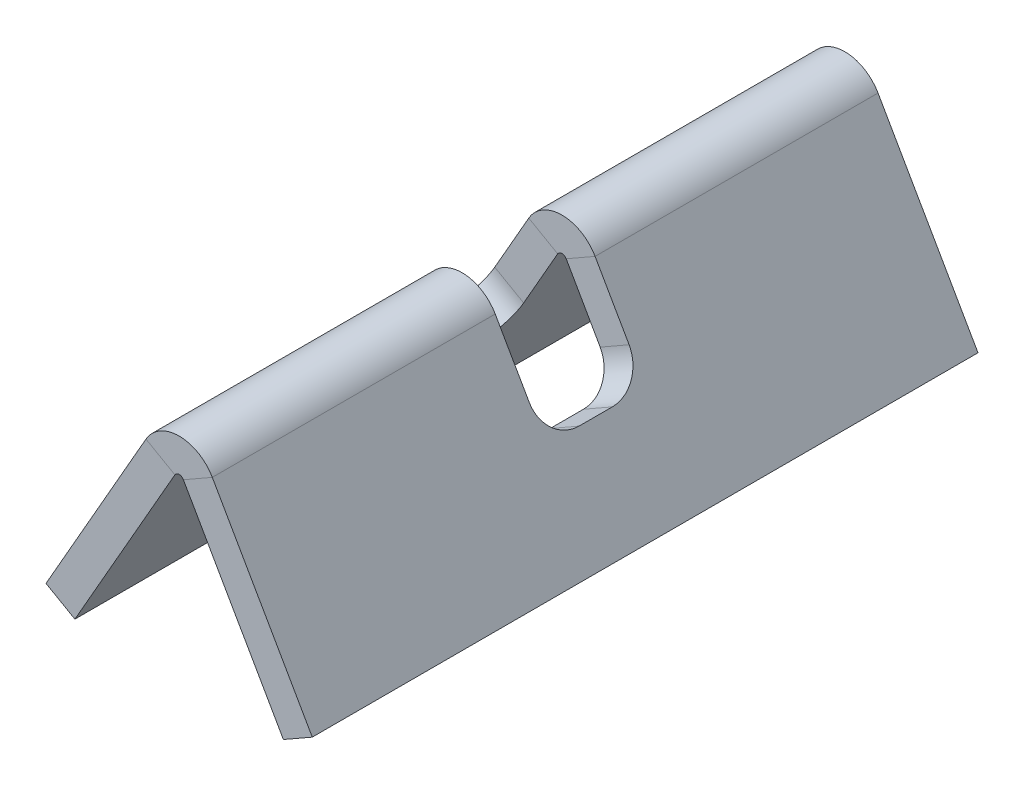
ISO-10303-21;
HEADER;
FILE_DESCRIPTION(('STEP AP214'),'2;1');
FILE_NAME('part.step','',(''),(''),'','','');
FILE_SCHEMA(('AUTOMOTIVE_DESIGN { 1 0 10303 214 1 1 1 1 }'));
ENDSEC;
DATA;
#1=APPLICATION_CONTEXT('core data for automotive mechanical design processes');
#2=APPLICATION_PROTOCOL_DEFINITION('international standard','automotive_design',2000,#1);
#3=PRODUCT_CONTEXT('',#1,'mechanical');
#4=PRODUCT('Part','Part','',(#3));
#5=PRODUCT_RELATED_PRODUCT_CATEGORY('part','',(#4));
#6=PRODUCT_DEFINITION_FORMATION('','',#4);
#7=PRODUCT_DEFINITION_CONTEXT('part definition',#1,'design');
#8=PRODUCT_DEFINITION('design','',#6,#7);
#9=PRODUCT_DEFINITION_SHAPE('','',#8);
#10=(LENGTH_UNIT() NAMED_UNIT(*) SI_UNIT(.MILLI.,.METRE.));
#11=(NAMED_UNIT(*) PLANE_ANGLE_UNIT() SI_UNIT($,.RADIAN.));
#12=(NAMED_UNIT(*) SI_UNIT($,.STERADIAN.) SOLID_ANGLE_UNIT());
#13=UNCERTAINTY_MEASURE_WITH_UNIT(LENGTH_MEASURE(1.E-05),#10,'distance_accuracy_value','');
#14=(GEOMETRIC_REPRESENTATION_CONTEXT(3) GLOBAL_UNCERTAINTY_ASSIGNED_CONTEXT((#13)) GLOBAL_UNIT_ASSIGNED_CONTEXT((#10,
#11,#12)) REPRESENTATION_CONTEXT('',''));
#15=CARTESIAN_POINT('',(0.,0.,0.));
#16=DIRECTION('',(0.,0.,1.));
#17=DIRECTION('',(1.,0.,0.));
#18=AXIS2_PLACEMENT_3D('',#15,#16,#17);
#19=CARTESIAN_POINT('',(-4.3412157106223,-2.48069469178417,50.));
#20=DIRECTION('',(0.868243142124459,0.496138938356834,0.));
#21=DIRECTION('',(-0.496138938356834,0.868243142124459,0.));
#22=AXIS2_PLACEMENT_3D('',#19,#20,#21);
#23=PLANE('',#22);
#24=DIRECTION('',(0.496138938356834,-0.868243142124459,0.));
#25=VECTOR('',#24,1.);
#26=CARTESIAN_POINT('',(-4.3412157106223,-2.48069469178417,7.5));
#27=LINE('',#26,#25);
#28=CARTESIAN_POINT('',(0.639547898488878,-11.1970310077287,7.5));
#29=VERTEX_POINT('',#28);
#30=CARTESIAN_POINT('',(5.74951816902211,-20.1394789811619,7.5));
#31=VERTEX_POINT('',#30);
#32=EDGE_CURVE('E178',#29,#31,#27,.T.);
#33=ORIENTED_EDGE('',*,*,#32,.T.);
#34=CARTESIAN_POINT('',(5.74951816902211,-20.1394789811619,2.5));
#35=DIRECTION('',(0.868243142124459,0.496138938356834,0.));
#36=DIRECTION('',(-0.496138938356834,0.868243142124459,0.));
#37=AXIS2_PLACEMENT_3D('',#34,#35,#36);
#38=CIRCLE('',#37,5.);
#39=CARTESIAN_POINT('',(8.23021286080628,-24.4806946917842,2.5));
#40=VERTEX_POINT('',#39);
#41=EDGE_CURVE('E269',#31,#40,#38,.T.);
#42=ORIENTED_EDGE('',*,*,#41,.T.);
#43=DIRECTION('',(0.,0.,1.));
#44=VECTOR('',#43,1.);
#45=CARTESIAN_POINT('',(8.23021286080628,-24.4806946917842,50.));
#46=LINE('',#45,#44);
#47=CARTESIAN_POINT('',(8.23021286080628,-24.4806946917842,-2.5));
#48=VERTEX_POINT('',#47);
#49=EDGE_CURVE('E311',#40,#48,#46,.F.);
#50=ORIENTED_EDGE('',*,*,#49,.T.);
#51=CARTESIAN_POINT('',(5.7495181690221,-20.1394789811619,-2.5));
#52=DIRECTION('',(0.868243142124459,0.496138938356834,0.));
#53=DIRECTION('',(-0.496138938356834,0.868243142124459,0.));
#54=AXIS2_PLACEMENT_3D('',#51,#52,#53);
#55=CIRCLE('',#54,5.);
#56=CARTESIAN_POINT('',(5.74951816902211,-20.1394789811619,-7.5));
#57=VERTEX_POINT('',#56);
#58=EDGE_CURVE('E273',#48,#57,#55,.T.);
#59=ORIENTED_EDGE('',*,*,#58,.T.);
#60=DIRECTION('',(0.496138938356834,-0.868243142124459,0.));
#61=VECTOR('',#60,1.);
#62=CARTESIAN_POINT('',(-4.3412157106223,-2.48069469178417,-7.5));
#63=LINE('',#62,#61);
#64=CARTESIAN_POINT('',(0.639547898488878,-11.1970310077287,-7.5));
#65=VERTEX_POINT('',#64);
#66=EDGE_CURVE('E189',#65,#57,#63,.T.);
#67=ORIENTED_EDGE('',*,*,#66,.F.);
#68=DIRECTION('',(0.,0.,-1.));
#69=VECTOR('',#68,1.);
#70=CARTESIAN_POINT('',(0.639547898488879,-11.1970310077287,50.));
#71=LINE('',#70,#69);
#72=CARTESIAN_POINT('',(0.639547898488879,-11.1970310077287,-50.));
#73=VERTEX_POINT('',#72);
#74=EDGE_CURVE('E218',#65,#73,#71,.T.);
#75=ORIENTED_EDGE('',*,*,#74,.T.);
#76=DIRECTION('',(0.496138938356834,-0.868243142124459,0.));
#77=VECTOR('',#76,1.);
#78=CARTESIAN_POINT('',(-4.3412157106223,-2.48069469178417,-50.));
#79=LINE('',#78,#77);
#80=CARTESIAN_POINT('',(15.6587842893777,-37.4806946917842,-50.));
#81=VERTEX_POINT('',#80);
#82=EDGE_CURVE('E200',#73,#81,#79,.T.);
#83=ORIENTED_EDGE('',*,*,#82,.T.);
#84=DIRECTION('',(0.,0.,-1.));
#85=VECTOR('',#84,1.);
#86=CARTESIAN_POINT('',(15.6587842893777,-37.4806946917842,50.));
#87=LINE('',#86,#85);
#88=CARTESIAN_POINT('',(15.6587842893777,-37.4806946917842,50.));
#89=VERTEX_POINT('',#88);
#90=EDGE_CURVE('E240',#89,#81,#87,.T.);
#91=ORIENTED_EDGE('',*,*,#90,.F.);
#92=DIRECTION('',(0.496138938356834,-0.868243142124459,0.));
#93=VECTOR('',#92,1.);
#94=CARTESIAN_POINT('',(-4.3412157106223,-2.48069469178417,50.));
#95=LINE('',#94,#93);
#96=CARTESIAN_POINT('',(0.639547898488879,-11.1970310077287,50.));
#97=VERTEX_POINT('',#96);
#98=EDGE_CURVE('E216',#97,#89,#95,.T.);
#99=ORIENTED_EDGE('',*,*,#98,.F.);
#100=EDGE_CURVE('E208',#97,#29,#71,.T.);
#101=ORIENTED_EDGE('',*,*,#100,.T.);
#102=EDGE_LOOP('',(#33,#42,#50,#59,#67,#75,#83,#91,#99,#101));
#103=FACE_BOUND('',#102,.T.);
#104=ADVANCED_FACE('F41',(#103),#23,.F.);
#105=CARTESIAN_POINT('',(0.,0.,50.));
#106=DIRECTION('',(0.868243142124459,0.496138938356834,0.));
#107=DIRECTION('',(-0.496138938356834,0.868243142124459,0.));
#108=AXIS2_PLACEMENT_3D('',#105,#106,#107);
#109=PLANE('',#108);
#110=DIRECTION('',(0.,0.,-1.));
#111=VECTOR('',#110,1.);
#112=CARTESIAN_POINT('',(12.5714285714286,-22.,50.));
#113=LINE('',#112,#111);
#114=CARTESIAN_POINT('',(12.5714285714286,-22.,2.5));
#115=VERTEX_POINT('',#114);
#116=CARTESIAN_POINT('',(12.5714285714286,-22.,-2.5));
#117=VERTEX_POINT('',#116);
#118=EDGE_CURVE('E310',#115,#117,#113,.T.);
#119=ORIENTED_EDGE('',*,*,#118,.F.);
#120=CARTESIAN_POINT('',(10.0907338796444,-17.6587842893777,2.5));
#121=DIRECTION('',(0.868243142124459,0.496138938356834,0.));
#122=DIRECTION('',(-0.496138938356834,0.868243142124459,0.));
#123=AXIS2_PLACEMENT_3D('',#120,#121,#122);
#124=CIRCLE('',#123,5.);
#125=CARTESIAN_POINT('',(10.0907338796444,-17.6587842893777,7.5));
#126=VERTEX_POINT('',#125);
#127=EDGE_CURVE('E271',#115,#126,#124,.F.);
#128=ORIENTED_EDGE('',*,*,#127,.T.);
#129=DIRECTION('',(-0.496138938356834,0.868243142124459,0.));
#130=VECTOR('',#129,1.);
#131=CARTESIAN_POINT('',(0.,0.,7.5));
#132=LINE('',#131,#130);
#133=CARTESIAN_POINT('',(4.98076360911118,-8.71633631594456,7.5));
#134=VERTEX_POINT('',#133);
#135=EDGE_CURVE('E316',#134,#126,#132,.F.);
#136=ORIENTED_EDGE('',*,*,#135,.F.);
#137=DIRECTION('',(0.,0.,-1.));
#138=VECTOR('',#137,1.);
#139=CARTESIAN_POINT('',(4.98076360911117,-8.71633631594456,50.));
#140=LINE('',#139,#138);
#141=CARTESIAN_POINT('',(4.98076360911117,-8.71633631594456,50.));
#142=VERTEX_POINT('',#141);
#143=EDGE_CURVE('E235',#142,#134,#140,.T.);
#144=ORIENTED_EDGE('',*,*,#143,.F.);
#145=DIRECTION('',(0.496138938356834,-0.868243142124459,0.));
#146=VECTOR('',#145,1.);
#147=CARTESIAN_POINT('',(0.,0.,50.));
#148=LINE('',#147,#146);
#149=CARTESIAN_POINT('',(20.,-35.,50.));
#150=VERTEX_POINT('',#149);
#151=EDGE_CURVE('E328',#142,#150,#148,.T.);
#152=ORIENTED_EDGE('',*,*,#151,.T.);
#153=DIRECTION('',(0.,0.,-1.));
#154=VECTOR('',#153,1.);
#155=CARTESIAN_POINT('',(20.,-35.,50.));
#156=LINE('',#155,#154);
#157=CARTESIAN_POINT('',(20.,-35.,-50.));
#158=VERTEX_POINT('',#157);
#159=EDGE_CURVE('E238',#150,#158,#156,.T.);
#160=ORIENTED_EDGE('',*,*,#159,.T.);
#161=DIRECTION('',(0.496138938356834,-0.868243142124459,0.));
#162=VECTOR('',#161,1.);
#163=CARTESIAN_POINT('',(0.,0.,-50.));
#164=LINE('',#163,#162);
#165=CARTESIAN_POINT('',(4.98076360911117,-8.71633631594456,-50.));
#166=VERTEX_POINT('',#165);
#167=EDGE_CURVE('E350',#166,#158,#164,.T.);
#168=ORIENTED_EDGE('',*,*,#167,.F.);
#169=CARTESIAN_POINT('',(4.98076360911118,-8.71633631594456,-7.5));
#170=VERTEX_POINT('',#169);
#171=EDGE_CURVE('E234',#170,#166,#140,.T.);
#172=ORIENTED_EDGE('',*,*,#171,.F.);
#173=DIRECTION('',(-0.496138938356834,0.868243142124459,0.));
#174=VECTOR('',#173,1.);
#175=CARTESIAN_POINT('',(0.,0.,-7.5));
#176=LINE('',#175,#174);
#177=CARTESIAN_POINT('',(10.0907338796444,-17.6587842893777,-7.5));
#178=VERTEX_POINT('',#177);
#179=EDGE_CURVE('E188',#170,#178,#176,.F.);
#180=ORIENTED_EDGE('',*,*,#179,.T.);
#181=CARTESIAN_POINT('',(10.0907338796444,-17.6587842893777,-2.5));
#182=DIRECTION('',(0.868243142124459,0.496138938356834,0.));
#183=DIRECTION('',(-0.496138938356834,0.868243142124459,0.));
#184=AXIS2_PLACEMENT_3D('',#181,#182,#183);
#185=CIRCLE('',#184,5.);
#186=EDGE_CURVE('E275',#178,#117,#185,.F.);
#187=ORIENTED_EDGE('',*,*,#186,.T.);
#188=EDGE_LOOP('',(#119,#128,#136,#144,#152,#160,#168,#172,#180,#187));
#189=FACE_BOUND('',#188,.T.);
#190=ADVANCED_FACE('F423',(#189),#109,.T.);
#191=CARTESIAN_POINT('',(0.,-11.5624869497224,50.));
#192=DIRECTION('',(0.,0.,-1.));
#193=DIRECTION('',(-1.,0.,0.));
#194=AXIS2_PLACEMENT_3D('',#191,#192,#193);
#195=CYLINDRICAL_SURFACE('',#194,5.7366);
#196=ORIENTED_EDGE('',*,*,#143,.T.);
#197=CARTESIAN_POINT('',(0.,-11.5624869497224,7.5));
#198=DIRECTION('',(0.,0.,1.));
#199=DIRECTION('',(1.,0.,0.));
#200=AXIS2_PLACEMENT_3D('',#197,#198,#199);
#201=CIRCLE('',#200,5.7366);
#202=CARTESIAN_POINT('',(-4.98076360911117,-8.71633631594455,7.5));
#203=VERTEX_POINT('',#202);
#204=EDGE_CURVE('E199',#203,#134,#201,.F.);
#205=ORIENTED_EDGE('',*,*,#204,.F.);
#206=DIRECTION('',(0.,0.,-1.));
#207=VECTOR('',#206,1.);
#208=CARTESIAN_POINT('',(-4.98076360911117,-8.71633631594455,50.));
#209=LINE('',#208,#207);
#210=CARTESIAN_POINT('',(-4.98076360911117,-8.71633631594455,50.));
#211=VERTEX_POINT('',#210);
#212=EDGE_CURVE('E231',#211,#203,#209,.T.);
#213=ORIENTED_EDGE('',*,*,#212,.F.);
#214=CARTESIAN_POINT('',(0.,-11.5624869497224,50.));
#215=DIRECTION('',(0.,0.,1.));
#216=DIRECTION('',(1.,0.,0.));
#217=AXIS2_PLACEMENT_3D('',#214,#215,#216);
#218=CIRCLE('',#217,5.7366);
#219=EDGE_CURVE('E331',#211,#142,#218,.F.);
#220=ORIENTED_EDGE('',*,*,#219,.T.);
#221=EDGE_LOOP('',(#196,#205,#213,#220));
#222=FACE_BOUND('',#221,.T.);
#223=ADVANCED_FACE('F405',(#222),#195,.T.);
#224=CARTESIAN_POINT('',(-4.98076360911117,-8.71633631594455,-7.5));
#225=VERTEX_POINT('',#224);
#226=CARTESIAN_POINT('',(-4.98076360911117,-8.71633631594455,-50.));
#227=VERTEX_POINT('',#226);
#228=EDGE_CURVE('E230',#225,#227,#209,.T.);
#229=ORIENTED_EDGE('',*,*,#228,.F.);
#230=CARTESIAN_POINT('',(0.,-11.5624869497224,-7.5));
#231=DIRECTION('',(0.,0.,1.));
#232=DIRECTION('',(1.,0.,0.));
#233=AXIS2_PLACEMENT_3D('',#230,#231,#232);
#234=CIRCLE('',#233,5.7366);
#235=EDGE_CURVE('E416',#225,#170,#234,.F.);
#236=ORIENTED_EDGE('',*,*,#235,.T.);
#237=ORIENTED_EDGE('',*,*,#171,.T.);
#238=CARTESIAN_POINT('',(0.,-11.5624869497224,-50.));
#239=DIRECTION('',(0.,0.,1.));
#240=DIRECTION('',(1.,0.,0.));
#241=AXIS2_PLACEMENT_3D('',#238,#239,#240);
#242=CIRCLE('',#241,5.7366);
#243=EDGE_CURVE('E353',#227,#166,#242,.F.);
#244=ORIENTED_EDGE('',*,*,#243,.F.);
#245=EDGE_LOOP('',(#229,#236,#237,#244));
#246=FACE_BOUND('',#245,.T.);
#247=ADVANCED_FACE('F383',(#246),#195,.T.);
#248=CARTESIAN_POINT('',(0.,0.,50.));
#249=DIRECTION('',(-0.868243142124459,0.496138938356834,0.));
#250=DIRECTION('',(-0.496138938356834,-0.868243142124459,0.));
#251=AXIS2_PLACEMENT_3D('',#248,#249,#250);
#252=PLANE('',#251);
#253=ORIENTED_EDGE('',*,*,#212,.T.);
#254=DIRECTION('',(0.496138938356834,0.868243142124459,0.));
#255=VECTOR('',#254,1.);
#256=CARTESIAN_POINT('',(0.,0.,7.5));
#257=LINE('',#256,#255);
#258=CARTESIAN_POINT('',(-10.0907338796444,-17.6587842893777,7.5));
#259=VERTEX_POINT('',#258);
#260=EDGE_CURVE('E302',#259,#203,#257,.T.);
#261=ORIENTED_EDGE('',*,*,#260,.F.);
#262=CARTESIAN_POINT('',(-10.0907338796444,-17.6587842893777,2.5));
#263=DIRECTION('',(-0.868243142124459,0.496138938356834,0.));
#264=DIRECTION('',(-0.496138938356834,-0.868243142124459,0.));
#265=AXIS2_PLACEMENT_3D('',#262,#263,#264);
#266=CIRCLE('',#265,5.);
#267=CARTESIAN_POINT('',(-12.5714285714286,-22.,2.5));
#268=VERTEX_POINT('',#267);
#269=EDGE_CURVE('E279',#259,#268,#266,.F.);
#270=ORIENTED_EDGE('',*,*,#269,.T.);
#271=DIRECTION('',(0.,0.,1.));
#272=VECTOR('',#271,1.);
#273=CARTESIAN_POINT('',(-12.5714285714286,-22.,50.));
#274=LINE('',#273,#272);
#275=CARTESIAN_POINT('',(-12.5714285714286,-22.,-2.5));
#276=VERTEX_POINT('',#275);
#277=EDGE_CURVE('E300',#276,#268,#274,.T.);
#278=ORIENTED_EDGE('',*,*,#277,.F.);
#279=CARTESIAN_POINT('',(-10.0907338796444,-17.6587842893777,-2.5));
#280=DIRECTION('',(-0.868243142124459,0.496138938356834,0.));
#281=DIRECTION('',(-0.496138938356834,-0.868243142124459,0.));
#282=AXIS2_PLACEMENT_3D('',#279,#280,#281);
#283=CIRCLE('',#282,5.);
#284=CARTESIAN_POINT('',(-10.0907338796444,-17.6587842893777,-7.5));
#285=VERTEX_POINT('',#284);
#286=EDGE_CURVE('E11',#276,#285,#283,.F.);
#287=ORIENTED_EDGE('',*,*,#286,.T.);
#288=DIRECTION('',(0.496138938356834,0.868243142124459,0.));
#289=VECTOR('',#288,1.);
#290=CARTESIAN_POINT('',(0.,0.,-7.5));
#291=LINE('',#290,#289);
#292=EDGE_CURVE('E212',#285,#225,#291,.T.);
#293=ORIENTED_EDGE('',*,*,#292,.T.);
#294=ORIENTED_EDGE('',*,*,#228,.T.);
#295=DIRECTION('',(0.496138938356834,0.868243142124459,0.));
#296=VECTOR('',#295,1.);
#297=CARTESIAN_POINT('',(0.,0.,-50.));
#298=LINE('',#297,#296);
#299=CARTESIAN_POINT('',(-20.,-35.,-50.));
#300=VERTEX_POINT('',#299);
#301=EDGE_CURVE('E356',#300,#227,#298,.T.);
#302=ORIENTED_EDGE('',*,*,#301,.F.);
#303=DIRECTION('',(0.,0.,-1.));
#304=VECTOR('',#303,1.);
#305=CARTESIAN_POINT('',(-20.,-35.,50.));
#306=LINE('',#305,#304);
#307=CARTESIAN_POINT('',(-20.,-35.,50.));
#308=VERTEX_POINT('',#307);
#309=EDGE_CURVE('E228',#308,#300,#306,.T.);
#310=ORIENTED_EDGE('',*,*,#309,.F.);
#311=DIRECTION('',(0.496138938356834,0.868243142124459,0.));
#312=VECTOR('',#311,1.);
#313=CARTESIAN_POINT('',(0.,0.,50.));
#314=LINE('',#313,#312);
#315=EDGE_CURVE('E334',#308,#211,#314,.T.);
#316=ORIENTED_EDGE('',*,*,#315,.T.);
#317=EDGE_LOOP('',(#253,#261,#270,#278,#287,#293,#294,#302,#310,#316));
#318=FACE_BOUND('',#317,.T.);
#319=ADVANCED_FACE('F390',(#318),#252,.T.);
#320=CARTESIAN_POINT('',(4.3412157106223,-2.48069469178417,50.));
#321=DIRECTION('',(-0.868243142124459,0.496138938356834,0.));
#322=DIRECTION('',(-0.496138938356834,-0.868243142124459,0.));
#323=AXIS2_PLACEMENT_3D('',#320,#321,#322);
#324=PLANE('',#323);
#325=DIRECTION('',(0.,0.,1.));
#326=VECTOR('',#325,1.);
#327=CARTESIAN_POINT('',(-8.23021286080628,-24.4806946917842,50.));
#328=LINE('',#327,#326);
#329=CARTESIAN_POINT('',(-8.23021286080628,-24.4806946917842,-2.50000000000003));
#330=VERTEX_POINT('',#329);
#331=CARTESIAN_POINT('',(-8.23021286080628,-24.4806946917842,2.49999999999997));
#332=VERTEX_POINT('',#331);
#333=EDGE_CURVE('E285',#330,#332,#328,.T.);
#334=ORIENTED_EDGE('',*,*,#333,.T.);
#335=CARTESIAN_POINT('',(-5.7495181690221,-20.1394789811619,2.5));
#336=DIRECTION('',(-0.868243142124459,0.496138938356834,0.));
#337=DIRECTION('',(-0.496138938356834,-0.868243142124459,0.));
#338=AXIS2_PLACEMENT_3D('',#335,#336,#337);
#339=CIRCLE('',#338,5.);
#340=CARTESIAN_POINT('',(-5.74951816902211,-20.1394789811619,7.49999999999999));
#341=VERTEX_POINT('',#340);
#342=EDGE_CURVE('E277',#332,#341,#339,.T.);
#343=ORIENTED_EDGE('',*,*,#342,.T.);
#344=DIRECTION('',(-0.496138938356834,-0.868243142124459,0.));
#345=VECTOR('',#344,1.);
#346=CARTESIAN_POINT('',(4.3412157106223,-2.48069469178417,7.49999999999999));
#347=LINE('',#346,#345);
#348=CARTESIAN_POINT('',(-0.639547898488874,-11.1970310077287,7.5));
#349=VERTEX_POINT('',#348);
#350=EDGE_CURVE('E292',#341,#349,#347,.F.);
#351=ORIENTED_EDGE('',*,*,#350,.T.);
#352=DIRECTION('',(0.,0.,-1.));
#353=VECTOR('',#352,1.);
#354=CARTESIAN_POINT('',(-0.639547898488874,-11.1970310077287,50.));
#355=LINE('',#354,#353);
#356=CARTESIAN_POINT('',(-0.639547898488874,-11.1970310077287,50.));
#357=VERTEX_POINT('',#356);
#358=EDGE_CURVE('E211',#357,#349,#355,.T.);
#359=ORIENTED_EDGE('',*,*,#358,.F.);
#360=DIRECTION('',(0.496138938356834,0.868243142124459,0.));
#361=VECTOR('',#360,1.);
#362=CARTESIAN_POINT('',(4.3412157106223,-2.48069469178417,50.));
#363=LINE('',#362,#361);
#364=CARTESIAN_POINT('',(-15.6587842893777,-37.4806946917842,50.));
#365=VERTEX_POINT('',#364);
#366=EDGE_CURVE('E340',#365,#357,#363,.T.);
#367=ORIENTED_EDGE('',*,*,#366,.F.);
#368=DIRECTION('',(0.,0.,-1.));
#369=VECTOR('',#368,1.);
#370=CARTESIAN_POINT('',(-15.6587842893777,-37.4806946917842,50.));
#371=LINE('',#370,#369);
#372=CARTESIAN_POINT('',(-15.6587842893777,-37.4806946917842,-50.));
#373=VERTEX_POINT('',#372);
#374=EDGE_CURVE('E226',#365,#373,#371,.T.);
#375=ORIENTED_EDGE('',*,*,#374,.T.);
#376=DIRECTION('',(0.496138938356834,0.868243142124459,0.));
#377=VECTOR('',#376,1.);
#378=CARTESIAN_POINT('',(4.3412157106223,-2.48069469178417,-50.));
#379=LINE('',#378,#377);
#380=CARTESIAN_POINT('',(-0.639547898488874,-11.1970310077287,-50.));
#381=VERTEX_POINT('',#380);
#382=EDGE_CURVE('E361',#373,#381,#379,.T.);
#383=ORIENTED_EDGE('',*,*,#382,.T.);
#384=CARTESIAN_POINT('',(-0.639547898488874,-11.1970310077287,-7.5));
#385=VERTEX_POINT('',#384);
#386=EDGE_CURVE('E217',#385,#381,#355,.T.);
#387=ORIENTED_EDGE('',*,*,#386,.F.);
#388=DIRECTION('',(-0.496138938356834,-0.868243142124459,0.));
#389=VECTOR('',#388,1.);
#390=CARTESIAN_POINT('',(4.3412157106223,-2.48069469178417,-7.50000000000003));
#391=LINE('',#390,#389);
#392=CARTESIAN_POINT('',(-5.74951816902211,-20.1394789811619,-7.50000000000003));
#393=VERTEX_POINT('',#392);
#394=EDGE_CURVE('E287',#393,#385,#391,.F.);
#395=ORIENTED_EDGE('',*,*,#394,.F.);
#396=CARTESIAN_POINT('',(-5.7495181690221,-20.1394789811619,-2.5));
#397=DIRECTION('',(-0.868243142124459,0.496138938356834,0.));
#398=DIRECTION('',(-0.496138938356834,-0.868243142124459,0.));
#399=AXIS2_PLACEMENT_3D('',#396,#397,#398);
#400=CIRCLE('',#399,5.);
#401=EDGE_CURVE('E49',#393,#330,#400,.T.);
#402=ORIENTED_EDGE('',*,*,#401,.T.);
#403=EDGE_LOOP('',(#334,#343,#351,#359,#367,#375,#383,#387,#395,#402));
#404=FACE_BOUND('',#403,.T.);
#405=ADVANCED_FACE('F284',(#404),#324,.F.);
#406=CARTESIAN_POINT('',(0.,-11.5624869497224,50.));
#407=DIRECTION('',(0.,0.,-1.));
#408=DIRECTION('',(-1.,0.,0.));
#409=AXIS2_PLACEMENT_3D('',#406,#407,#408);
#410=CYLINDRICAL_SURFACE('',#409,0.7366);
#411=CARTESIAN_POINT('',(0.,-11.5624869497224,7.5));
#412=DIRECTION('',(0.,0.,-1.));
#413=DIRECTION('',(-1.,0.,0.));
#414=AXIS2_PLACEMENT_3D('',#411,#412,#413);
#415=CIRCLE('',#414,0.7366);
#416=EDGE_CURVE('E196',#349,#29,#415,.T.);
#417=ORIENTED_EDGE('',*,*,#416,.T.);
#418=ORIENTED_EDGE('',*,*,#100,.F.);
#419=CARTESIAN_POINT('',(0.,-11.5624869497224,50.));
#420=DIRECTION('',(0.,0.,1.));
#421=DIRECTION('',(1.,0.,0.));
#422=AXIS2_PLACEMENT_3D('',#419,#420,#421);
#423=CIRCLE('',#422,0.7366);
#424=EDGE_CURVE('E221',#357,#97,#423,.F.);
#425=ORIENTED_EDGE('',*,*,#424,.F.);
#426=ORIENTED_EDGE('',*,*,#358,.T.);
#427=EDGE_LOOP('',(#417,#418,#425,#426));
#428=FACE_BOUND('',#427,.T.);
#429=ADVANCED_FACE('F206',(#428),#410,.F.);
#430=CARTESIAN_POINT('',(0.,-11.5624869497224,-7.5));
#431=DIRECTION('',(0.,0.,-1.));
#432=DIRECTION('',(-1.,0.,0.));
#433=AXIS2_PLACEMENT_3D('',#430,#431,#432);
#434=CIRCLE('',#433,0.7366);
#435=EDGE_CURVE('E213',#385,#65,#434,.T.);
#436=ORIENTED_EDGE('',*,*,#435,.F.);
#437=ORIENTED_EDGE('',*,*,#386,.T.);
#438=CARTESIAN_POINT('',(0.,-11.5624869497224,-50.));
#439=DIRECTION('',(0.,0.,1.));
#440=DIRECTION('',(1.,0.,0.));
#441=AXIS2_PLACEMENT_3D('',#438,#439,#440);
#442=CIRCLE('',#441,0.7366);
#443=EDGE_CURVE('E223',#381,#73,#442,.F.);
#444=ORIENTED_EDGE('',*,*,#443,.T.);
#445=ORIENTED_EDGE('',*,*,#74,.F.);
#446=EDGE_LOOP('',(#436,#437,#444,#445));
#447=FACE_BOUND('',#446,.T.);
#448=ADVANCED_FACE('F370',(#447),#410,.F.);
#449=CARTESIAN_POINT('',(4.98076360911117,-8.71633631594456,50.));
#450=DIRECTION('',(0.,0.,1.));
#451=DIRECTION('',(1.,0.,0.));
#452=AXIS2_PLACEMENT_3D('',#449,#450,#451);
#453=PLANE('',#452);
#454=DIRECTION('',(-0.868243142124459,-0.496138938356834,0.));
#455=VECTOR('',#454,1.);
#456=CARTESIAN_POINT('',(4.98076360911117,-8.71633631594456,50.));
#457=LINE('',#456,#455);
#458=EDGE_CURVE('E250',#142,#97,#457,.T.);
#459=ORIENTED_EDGE('',*,*,#458,.F.);
#460=ORIENTED_EDGE('',*,*,#219,.F.);
#461=DIRECTION('',(-0.868243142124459,0.496138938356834,0.));
#462=VECTOR('',#461,1.);
#463=CARTESIAN_POINT('',(-0.639547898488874,-11.1970310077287,50.));
#464=LINE('',#463,#462);
#465=EDGE_CURVE('E248',#357,#211,#464,.T.);
#466=ORIENTED_EDGE('',*,*,#465,.F.);
#467=ORIENTED_EDGE('',*,*,#424,.T.);
#468=EDGE_LOOP('',(#459,#460,#466,#467));
#469=FACE_BOUND('',#468,.T.);
#470=ADVANCED_FACE('F401',(#469),#453,.T.);
#471=CARTESIAN_POINT('',(-0.639547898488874,-11.1970310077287,50.));
#472=DIRECTION('',(0.,0.,1.));
#473=DIRECTION('',(1.,0.,0.));
#474=AXIS2_PLACEMENT_3D('',#471,#472,#473);
#475=PLANE('',#474);
#476=ORIENTED_EDGE('',*,*,#151,.F.);
#477=ORIENTED_EDGE('',*,*,#458,.T.);
#478=ORIENTED_EDGE('',*,*,#98,.T.);
#479=DIRECTION('',(-0.868243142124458,-0.496138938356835,0.));
#480=VECTOR('',#479,1.);
#481=CARTESIAN_POINT('',(20.,-35.,50.));
#482=LINE('',#481,#480);
#483=EDGE_CURVE('E325',#150,#89,#482,.T.);
#484=ORIENTED_EDGE('',*,*,#483,.F.);
#485=EDGE_LOOP('',(#476,#477,#478,#484));
#486=FACE_BOUND('',#485,.T.);
#487=ADVANCED_FACE('F430',(#486),#475,.T.);
#488=CARTESIAN_POINT('',(-4.98076360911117,-8.71633631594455,-50.));
#489=DIRECTION('',(0.,0.,-1.));
#490=DIRECTION('',(-1.,0.,0.));
#491=AXIS2_PLACEMENT_3D('',#488,#489,#490);
#492=PLANE('',#491);
#493=DIRECTION('',(0.868243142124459,-0.496138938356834,0.));
#494=VECTOR('',#493,1.);
#495=CARTESIAN_POINT('',(-4.98076360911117,-8.71633631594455,-50.));
#496=LINE('',#495,#494);
#497=EDGE_CURVE('E245',#227,#381,#496,.T.);
#498=ORIENTED_EDGE('',*,*,#497,.F.);
#499=ORIENTED_EDGE('',*,*,#243,.T.);
#500=DIRECTION('',(0.868243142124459,0.496138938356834,0.));
#501=VECTOR('',#500,1.);
#502=CARTESIAN_POINT('',(0.639547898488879,-11.1970310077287,-50.));
#503=LINE('',#502,#501);
#504=EDGE_CURVE('E242',#73,#166,#503,.T.);
#505=ORIENTED_EDGE('',*,*,#504,.F.);
#506=ORIENTED_EDGE('',*,*,#443,.F.);
#507=EDGE_LOOP('',(#498,#499,#505,#506));
#508=FACE_BOUND('',#507,.T.);
#509=ADVANCED_FACE('F379',(#508),#492,.T.);
#510=CARTESIAN_POINT('',(0.639547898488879,-11.1970310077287,-50.));
#511=DIRECTION('',(0.,0.,-1.));
#512=DIRECTION('',(-1.,0.,0.));
#513=AXIS2_PLACEMENT_3D('',#510,#511,#512);
#514=PLANE('',#513);
#515=ORIENTED_EDGE('',*,*,#301,.T.);
#516=ORIENTED_EDGE('',*,*,#497,.T.);
#517=ORIENTED_EDGE('',*,*,#382,.F.);
#518=DIRECTION('',(-0.868243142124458,0.496138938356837,0.));
#519=VECTOR('',#518,1.);
#520=CARTESIAN_POINT('',(-15.6587842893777,-37.4806946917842,-50.));
#521=LINE('',#520,#519);
#522=EDGE_CURVE('E359',#373,#300,#521,.T.);
#523=ORIENTED_EDGE('',*,*,#522,.T.);
#524=EDGE_LOOP('',(#515,#516,#517,#523));
#525=FACE_BOUND('',#524,.T.);
#526=ADVANCED_FACE('F388',(#525),#514,.T.);
#527=CARTESIAN_POINT('',(20.,-35.,50.));
#528=DIRECTION('',(0.496138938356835,-0.868243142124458,0.));
#529=DIRECTION('',(0.868243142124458,0.496138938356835,0.));
#530=AXIS2_PLACEMENT_3D('',#527,#528,#529);
#531=PLANE('',#530);
#532=DIRECTION('',(-0.868243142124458,-0.496138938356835,0.));
#533=VECTOR('',#532,1.);
#534=CARTESIAN_POINT('',(20.,-35.,-50.));
#535=LINE('',#534,#533);
#536=EDGE_CURVE('E347',#158,#81,#535,.T.);
#537=ORIENTED_EDGE('',*,*,#536,.F.);
#538=ORIENTED_EDGE('',*,*,#159,.F.);
#539=ORIENTED_EDGE('',*,*,#483,.T.);
#540=ORIENTED_EDGE('',*,*,#90,.T.);
#541=EDGE_LOOP('',(#537,#538,#539,#540));
#542=FACE_BOUND('',#541,.T.);
#543=ADVANCED_FACE('F428',(#542),#531,.T.);
#544=CARTESIAN_POINT('',(-15.6587842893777,-37.4806946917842,50.));
#545=DIRECTION('',(-0.496138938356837,-0.868243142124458,0.));
#546=DIRECTION('',(0.868243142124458,-0.496138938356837,0.));
#547=AXIS2_PLACEMENT_3D('',#544,#545,#546);
#548=PLANE('',#547);
#549=ORIENTED_EDGE('',*,*,#522,.F.);
#550=ORIENTED_EDGE('',*,*,#374,.F.);
#551=DIRECTION('',(-0.868243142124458,0.496138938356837,0.));
#552=VECTOR('',#551,1.);
#553=CARTESIAN_POINT('',(-15.6587842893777,-37.4806946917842,50.));
#554=LINE('',#553,#552);
#555=EDGE_CURVE('E337',#365,#308,#554,.T.);
#556=ORIENTED_EDGE('',*,*,#555,.T.);
#557=ORIENTED_EDGE('',*,*,#309,.T.);
#558=EDGE_LOOP('',(#549,#550,#556,#557));
#559=FACE_BOUND('',#558,.T.);
#560=ADVANCED_FACE('F397',(#559),#548,.T.);
#561=CARTESIAN_POINT('',(0.,-11.5624869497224,50.));
#562=DIRECTION('',(0.,0.,1.));
#563=DIRECTION('',(1.,0.,0.));
#564=AXIS2_PLACEMENT_3D('',#561,#562,#563);
#565=PLANE('',#564);
#566=ORIENTED_EDGE('',*,*,#366,.T.);
#567=ORIENTED_EDGE('',*,*,#465,.T.);
#568=ORIENTED_EDGE('',*,*,#315,.F.);
#569=ORIENTED_EDGE('',*,*,#555,.F.);
#570=EDGE_LOOP('',(#566,#567,#568,#569));
#571=FACE_BOUND('',#570,.T.);
#572=ADVANCED_FACE('F395',(#571),#565,.T.);
#573=CARTESIAN_POINT('',(0.,-11.5624869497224,-50.));
#574=DIRECTION('',(0.,0.,1.));
#575=DIRECTION('',(1.,0.,0.));
#576=AXIS2_PLACEMENT_3D('',#573,#574,#575);
#577=PLANE('',#576);
#578=ORIENTED_EDGE('',*,*,#82,.F.);
#579=ORIENTED_EDGE('',*,*,#504,.T.);
#580=ORIENTED_EDGE('',*,*,#167,.T.);
#581=ORIENTED_EDGE('',*,*,#536,.T.);
#582=EDGE_LOOP('',(#578,#579,#580,#581));
#583=FACE_BOUND('',#582,.T.);
#584=ADVANCED_FACE('F375',(#583),#577,.F.);
#585=CARTESIAN_POINT('',(-4.3412157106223,-2.48069469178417,7.5));
#586=DIRECTION('',(0.,0.,1.));
#587=DIRECTION('',(0.496138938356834,-0.868243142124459,0.));
#588=AXIS2_PLACEMENT_3D('',#585,#586,#587);
#589=PLANE('',#588);
#590=ORIENTED_EDGE('',*,*,#135,.T.);
#591=DIRECTION('',(0.868243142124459,0.496138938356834,0.));
#592=VECTOR('',#591,1.);
#593=CARTESIAN_POINT('',(5.74951816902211,-20.1394789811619,7.5));
#594=LINE('',#593,#592);
#595=EDGE_CURVE('E185',#126,#31,#594,.F.);
#596=ORIENTED_EDGE('',*,*,#595,.T.);
#597=ORIENTED_EDGE('',*,*,#32,.F.);
#598=DIRECTION('',(-0.868243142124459,-0.496138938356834,0.));
#599=VECTOR('',#598,1.);
#600=CARTESIAN_POINT('',(0.639547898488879,-11.1970310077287,7.5));
#601=LINE('',#600,#599);
#602=EDGE_CURVE('E182',#29,#134,#601,.F.);
#603=ORIENTED_EDGE('',*,*,#602,.T.);
#604=EDGE_LOOP('',(#590,#596,#597,#603));
#605=FACE_BOUND('',#604,.T.);
#606=ADVANCED_FACE('F181',(#605),#589,.F.);
#607=CARTESIAN_POINT('',(-4.3412157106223,-2.48069469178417,-7.5));
#608=DIRECTION('',(0.,0.,1.));
#609=DIRECTION('',(0.496138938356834,-0.868243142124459,0.));
#610=AXIS2_PLACEMENT_3D('',#607,#608,#609);
#611=PLANE('',#610);
#612=ORIENTED_EDGE('',*,*,#66,.T.);
#613=DIRECTION('',(0.868243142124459,0.496138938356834,0.));
#614=VECTOR('',#613,1.);
#615=CARTESIAN_POINT('',(10.0907338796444,-17.6587842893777,-7.5));
#616=LINE('',#615,#614);
#617=EDGE_CURVE('E258',#57,#178,#616,.T.);
#618=ORIENTED_EDGE('',*,*,#617,.T.);
#619=ORIENTED_EDGE('',*,*,#179,.F.);
#620=DIRECTION('',(-0.868243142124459,-0.496138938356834,0.));
#621=VECTOR('',#620,1.);
#622=CARTESIAN_POINT('',(0.639547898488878,-11.1970310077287,-7.5));
#623=LINE('',#622,#621);
#624=EDGE_CURVE('E201',#65,#170,#623,.F.);
#625=ORIENTED_EDGE('',*,*,#624,.F.);
#626=EDGE_LOOP('',(#612,#618,#619,#625));
#627=FACE_BOUND('',#626,.T.);
#628=ADVANCED_FACE('F537',(#627),#611,.T.);
#629=CARTESIAN_POINT('',(12.5714285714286,-22.,50.));
#630=DIRECTION('',(0.496138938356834,-0.868243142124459,0.));
#631=DIRECTION('',(0.,0.,-1.));
#632=AXIS2_PLACEMENT_3D('',#629,#630,#631);
#633=PLANE('',#632);
#634=ORIENTED_EDGE('',*,*,#49,.F.);
#635=DIRECTION('',(0.868243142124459,0.496138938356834,0.));
#636=VECTOR('',#635,1.);
#637=CARTESIAN_POINT('',(12.5714285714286,-22.,2.5));
#638=LINE('',#637,#636);
#639=EDGE_CURVE('E256',#40,#115,#638,.T.);
#640=ORIENTED_EDGE('',*,*,#639,.T.);
#641=ORIENTED_EDGE('',*,*,#118,.T.);
#642=DIRECTION('',(-0.868243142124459,-0.496138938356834,0.));
#643=VECTOR('',#642,1.);
#644=CARTESIAN_POINT('',(8.23021286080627,-24.4806946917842,-2.5));
#645=LINE('',#644,#643);
#646=EDGE_CURVE('E253',#117,#48,#645,.T.);
#647=ORIENTED_EDGE('',*,*,#646,.T.);
#648=EDGE_LOOP('',(#634,#640,#641,#647));
#649=FACE_BOUND('',#648,.T.);
#650=ADVANCED_FACE('F534',(#649),#633,.F.);
#651=CARTESIAN_POINT('',(0.,0.,7.5));
#652=DIRECTION('',(0.,0.,1.));
#653=DIRECTION('',(0.496138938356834,0.868243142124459,0.));
#654=AXIS2_PLACEMENT_3D('',#651,#652,#653);
#655=PLANE('',#654);
#656=ORIENTED_EDGE('',*,*,#350,.F.);
#657=DIRECTION('',(-0.868243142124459,0.496138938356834,0.));
#658=VECTOR('',#657,1.);
#659=CARTESIAN_POINT('',(-10.0907338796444,-17.6587842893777,7.5));
#660=LINE('',#659,#658);
#661=EDGE_CURVE('E265',#341,#259,#660,.T.);
#662=ORIENTED_EDGE('',*,*,#661,.T.);
#663=ORIENTED_EDGE('',*,*,#260,.T.);
#664=DIRECTION('',(-0.868243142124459,0.496138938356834,0.));
#665=VECTOR('',#664,1.);
#666=CARTESIAN_POINT('',(-4.98076360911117,-8.71633631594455,7.5));
#667=LINE('',#666,#665);
#668=EDGE_CURVE('E308',#203,#349,#667,.F.);
#669=ORIENTED_EDGE('',*,*,#668,.T.);
#670=EDGE_LOOP('',(#656,#662,#663,#669));
#671=FACE_BOUND('',#670,.T.);
#672=ADVANCED_FACE('F412',(#671),#655,.F.);
#673=CARTESIAN_POINT('',(0.,0.,-7.5));
#674=DIRECTION('',(0.,0.,1.));
#675=DIRECTION('',(0.496138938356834,0.868243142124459,0.));
#676=AXIS2_PLACEMENT_3D('',#673,#674,#675);
#677=PLANE('',#676);
#678=ORIENTED_EDGE('',*,*,#292,.F.);
#679=DIRECTION('',(-0.868243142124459,0.496138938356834,0.));
#680=VECTOR('',#679,1.);
#681=CARTESIAN_POINT('',(-5.7495181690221,-20.1394789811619,-7.5));
#682=LINE('',#681,#680);
#683=EDGE_CURVE('E267',#285,#393,#682,.F.);
#684=ORIENTED_EDGE('',*,*,#683,.T.);
#685=ORIENTED_EDGE('',*,*,#394,.T.);
#686=DIRECTION('',(-0.868243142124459,0.496138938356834,0.));
#687=VECTOR('',#686,1.);
#688=CARTESIAN_POINT('',(-4.98076360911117,-8.71633631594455,-7.5));
#689=LINE('',#688,#687);
#690=EDGE_CURVE('E298',#225,#385,#689,.F.);
#691=ORIENTED_EDGE('',*,*,#690,.F.);
#692=EDGE_LOOP('',(#678,#684,#685,#691));
#693=FACE_BOUND('',#692,.T.);
#694=ADVANCED_FACE('F295',(#693),#677,.T.);
#695=CARTESIAN_POINT('',(-12.5714285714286,-22.,50.));
#696=DIRECTION('',(-0.496138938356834,-0.868243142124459,0.));
#697=DIRECTION('',(0.,0.,1.));
#698=AXIS2_PLACEMENT_3D('',#695,#696,#697);
#699=PLANE('',#698);
#700=ORIENTED_EDGE('',*,*,#277,.T.);
#701=DIRECTION('',(-0.868243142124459,0.496138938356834,0.));
#702=VECTOR('',#701,1.);
#703=CARTESIAN_POINT('',(-8.23021286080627,-24.4806946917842,2.5));
#704=LINE('',#703,#702);
#705=EDGE_CURVE('E262',#268,#332,#704,.F.);
#706=ORIENTED_EDGE('',*,*,#705,.T.);
#707=ORIENTED_EDGE('',*,*,#333,.F.);
#708=DIRECTION('',(0.868243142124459,-0.496138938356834,0.));
#709=VECTOR('',#708,1.);
#710=CARTESIAN_POINT('',(-12.5714285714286,-22.,-2.5));
#711=LINE('',#710,#709);
#712=EDGE_CURVE('E260',#330,#276,#711,.F.);
#713=ORIENTED_EDGE('',*,*,#712,.T.);
#714=EDGE_LOOP('',(#700,#706,#707,#713));
#715=FACE_BOUND('',#714,.T.);
#716=ADVANCED_FACE('F290',(#715),#699,.F.);
#717=CARTESIAN_POINT('',(0.,-11.5624869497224,7.5));
#718=DIRECTION('',(0.,0.,-1.));
#719=DIRECTION('',(-1.,0.,0.));
#720=AXIS2_PLACEMENT_3D('',#717,#718,#719);
#721=PLANE('',#720);
#722=ORIENTED_EDGE('',*,*,#668,.F.);
#723=ORIENTED_EDGE('',*,*,#204,.T.);
#724=ORIENTED_EDGE('',*,*,#602,.F.);
#725=ORIENTED_EDGE('',*,*,#416,.F.);
#726=EDGE_LOOP('',(#722,#723,#724,#725));
#727=FACE_BOUND('',#726,.T.);
#728=ADVANCED_FACE('F195',(#727),#721,.T.);
#729=CARTESIAN_POINT('',(0.,-11.5624869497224,-7.5));
#730=DIRECTION('',(0.,0.,-1.));
#731=DIRECTION('',(-1.,0.,0.));
#732=AXIS2_PLACEMENT_3D('',#729,#730,#731);
#733=PLANE('',#732);
#734=ORIENTED_EDGE('',*,*,#624,.T.);
#735=ORIENTED_EDGE('',*,*,#235,.F.);
#736=ORIENTED_EDGE('',*,*,#690,.T.);
#737=ORIENTED_EDGE('',*,*,#435,.T.);
#738=EDGE_LOOP('',(#734,#735,#736,#737));
#739=FACE_BOUND('',#738,.T.);
#740=ADVANCED_FACE('F420',(#739),#733,.F.);
#741=CARTESIAN_POINT('',(5.74951816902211,-20.1394789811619,2.5));
#742=DIRECTION('',(0.868243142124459,0.496138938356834,0.));
#743=DIRECTION('',(-0.496138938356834,0.868243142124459,0.));
#744=AXIS2_PLACEMENT_3D('',#741,#742,#743);
#745=CYLINDRICAL_SURFACE('',#744,5.);
#746=ORIENTED_EDGE('',*,*,#127,.F.);
#747=ORIENTED_EDGE('',*,*,#639,.F.);
#748=ORIENTED_EDGE('',*,*,#41,.F.);
#749=ORIENTED_EDGE('',*,*,#595,.F.);
#750=EDGE_LOOP('',(#746,#747,#748,#749));
#751=FACE_BOUND('',#750,.T.);
#752=ADVANCED_FACE('F497',(#751),#745,.F.);
#753=CARTESIAN_POINT('',(10.0907338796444,-17.6587842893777,-2.5));
#754=DIRECTION('',(-0.868243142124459,-0.496138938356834,0.));
#755=DIRECTION('',(0.496138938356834,-0.868243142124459,0.));
#756=AXIS2_PLACEMENT_3D('',#753,#754,#755);
#757=CYLINDRICAL_SURFACE('',#756,5.);
#758=ORIENTED_EDGE('',*,*,#186,.F.);
#759=ORIENTED_EDGE('',*,*,#617,.F.);
#760=ORIENTED_EDGE('',*,*,#58,.F.);
#761=ORIENTED_EDGE('',*,*,#646,.F.);
#762=EDGE_LOOP('',(#758,#759,#760,#761));
#763=FACE_BOUND('',#762,.T.);
#764=ADVANCED_FACE('F508',(#763),#757,.F.);
#765=CARTESIAN_POINT('',(-10.0907338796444,-17.6587842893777,2.5));
#766=DIRECTION('',(-0.868243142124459,0.496138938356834,0.));
#767=DIRECTION('',(-0.496138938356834,-0.868243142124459,0.));
#768=AXIS2_PLACEMENT_3D('',#765,#766,#767);
#769=CYLINDRICAL_SURFACE('',#768,5.);
#770=ORIENTED_EDGE('',*,*,#269,.F.);
#771=ORIENTED_EDGE('',*,*,#661,.F.);
#772=ORIENTED_EDGE('',*,*,#342,.F.);
#773=ORIENTED_EDGE('',*,*,#705,.F.);
#774=EDGE_LOOP('',(#770,#771,#772,#773));
#775=FACE_BOUND('',#774,.T.);
#776=ADVANCED_FACE('F411',(#775),#769,.F.);
#777=CARTESIAN_POINT('',(-10.0907338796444,-17.6587842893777,-2.5));
#778=DIRECTION('',(0.868243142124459,-0.496138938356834,0.));
#779=DIRECTION('',(0.496138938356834,0.868243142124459,0.));
#780=AXIS2_PLACEMENT_3D('',#777,#778,#779);
#781=CYLINDRICAL_SURFACE('',#780,5.);
#782=ORIENTED_EDGE('',*,*,#286,.F.);
#783=ORIENTED_EDGE('',*,*,#712,.F.);
#784=ORIENTED_EDGE('',*,*,#401,.F.);
#785=ORIENTED_EDGE('',*,*,#683,.F.);
#786=EDGE_LOOP('',(#782,#783,#784,#785));
#787=FACE_BOUND('',#786,.T.);
#788=ADVANCED_FACE('F43',(#787),#781,.F.);
#789=CLOSED_SHELL('',(#104,#190,#223,#247,#319,#405,#429,#448,#470,#487,#509,#526,#543,#560,
#572,#584,#606,#628,#650,#672,#694,#716,#728,#740,#752,#764,#776,#788));
#790=MANIFOLD_SOLID_BREP('B2',#789);
#791=ADVANCED_BREP_SHAPE_REPRESENTATION('',(#18,#790),#14);
#792=SHAPE_DEFINITION_REPRESENTATION(#9,#791);
ENDSEC;
END-ISO-10303-21;
